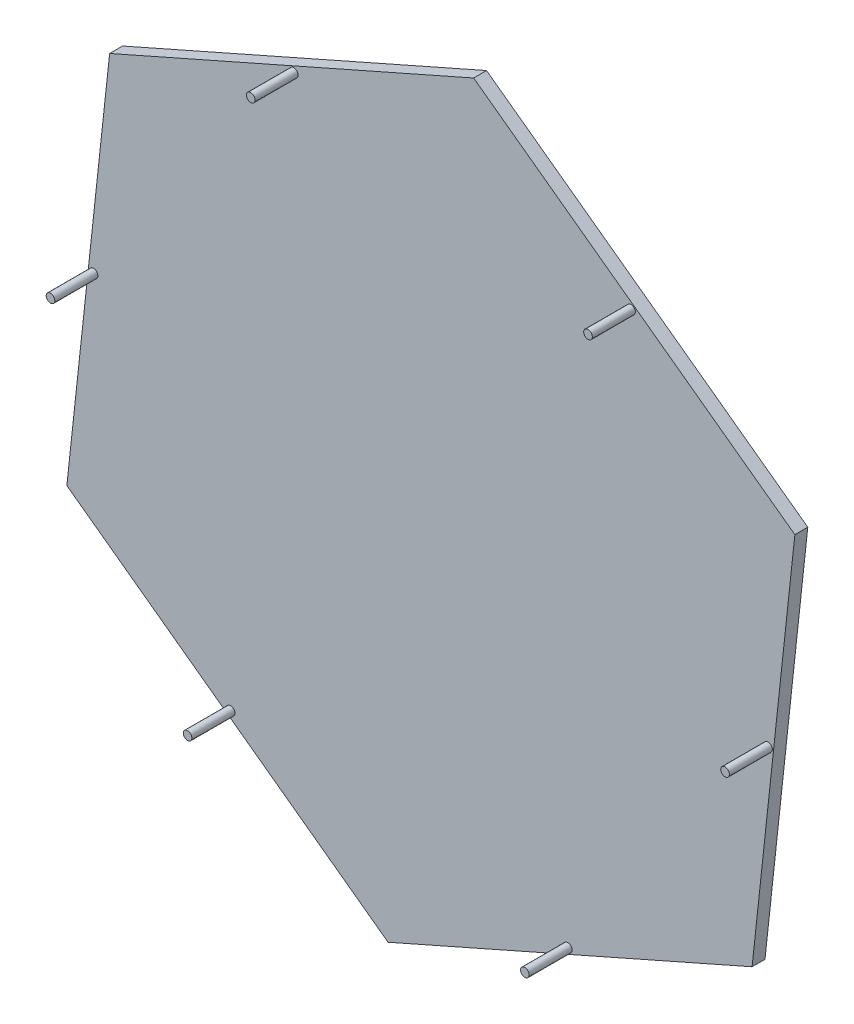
from build123d import *

# Parameters (mm, degrees)
BOSS_EXTRUDE1_DEPTH = 3.81
SKETCH7_R           = 1.27
BOSS_EXTRUDE3_DEPTH = 12.7


with BuildPart() as part:
    # Sketch1 → Boss-Extrude1 (new body)
    with BuildSketch(Plane.XY):
        Polygon((107.317877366, 47.395005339), (12.613660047, 116.637510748), (-94.704217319, 69.24250541), (-107.317877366, -47.395005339), (-12.613660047, -116.637510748), (94.704217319, -69.24250541), align=None)
    extrude(amount=BOSS_EXTRUDE1_DEPTH)

    # Sketch7 → Boss-Extrude3 (add)
    with BuildSketch(Plane.XY.offset(3.81)):
        with Locations((-40.403946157, 91.487820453)):
            Circle(SKETCH7_R)
        with Locations((-99.432749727, 10.753066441)):
            Circle(SKETCH7_R)
        with Locations((-59.02880357, -80.734754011)):
            Circle(SKETCH7_R)
        with Locations((40.403946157, -91.487820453)):
            Circle(SKETCH7_R)
        with Locations((99.432749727, -10.753066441)):
            Circle(SKETCH7_R)
        with Locations((59.02880357, 80.734754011)):
            Circle(SKETCH7_R)
    extrude(amount=BOSS_EXTRUDE3_DEPTH)


solid = part.part
